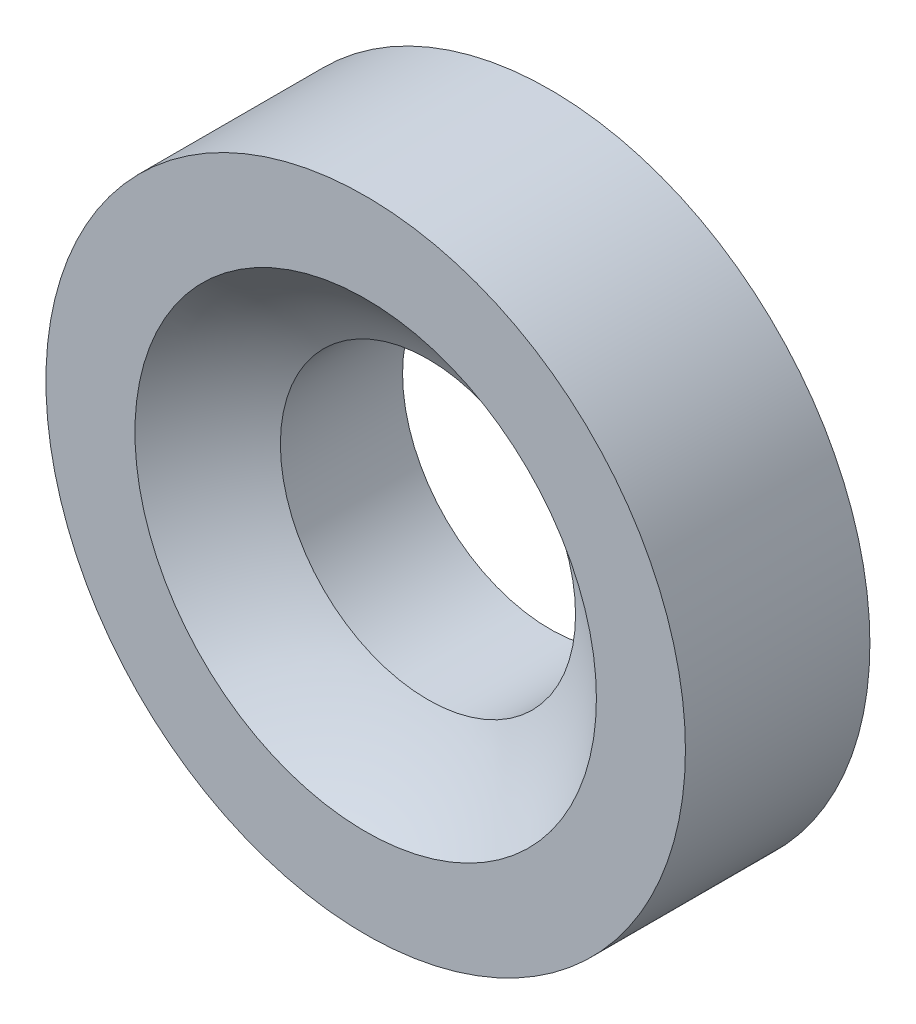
from build123d import *
from build123d.topology import SkipClean

# Parameters (mm, degrees)
ESQUISSE1_R             = 13
BASE_EXTRUSION_DEPTH    = 7.5
ESQUISSE3_R             = 6
ENL_V_MAT_EXTRU_2_DEPTH = 20.855729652


with BuildPart() as part:
    # Esquisse1 → Base-Extrusion (new body)
    with BuildSketch(Plane.XY):
        Circle(ESQUISSE1_R)
    extrude(amount=BASE_EXTRUSION_DEPTH)

    # Esquisse2 → Enlever de la mati_re-R_volution1 (revolve, cut)
    with SkipClean():  # the faces are left unmerged after this step: merging them gives an invalid solid
        with BuildSketch(Plane(origin=(0, 0, 0), x_dir=(1, 0, 0), z_dir=(0, 1, 0))):
            with BuildLine():
                Line((9.38083152, -7.5), (-9.38083152, -7.5))
                ThreePointArc((-9.38083152, -7.5), (0, -3.5), (9.38083152, -7.5))
            make_face()
        revolve(axis=Axis((-7.105242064, 0, 16.5), (1, 0, 0)), mode=Mode.SUBTRACT)

    # Esquisse3 → Enl_v. mat.-Extru.2 (cut, through all)
    with SkipClean():  # the faces are left unmerged after this step: merging them gives an invalid solid
        with BuildSketch(Plane(origin=(0, 0, 0), x_dir=(-1, 0, 0), z_dir=(0, 0, -1))):
            Circle(ESQUISSE3_R)
        extrude(amount=-ENL_V_MAT_EXTRU_2_DEPTH, mode=Mode.SUBTRACT)


solid = part.part
